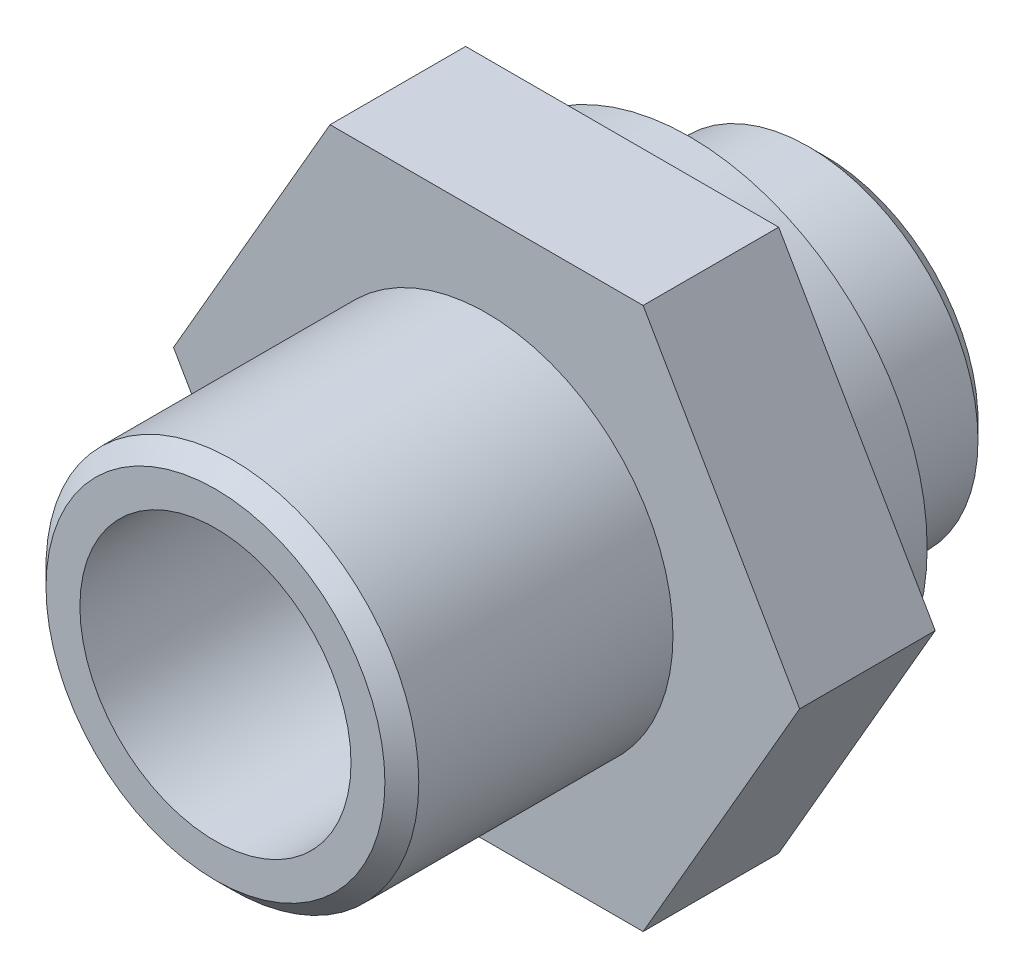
ISO-10303-21;
HEADER;
FILE_DESCRIPTION(('STEP AP214'),'2;1');
FILE_NAME('part.step','',(''),(''),'','','');
FILE_SCHEMA(('AUTOMOTIVE_DESIGN { 1 0 10303 214 1 1 1 1 }'));
ENDSEC;
DATA;
#1=APPLICATION_CONTEXT('core data for automotive mechanical design processes');
#2=APPLICATION_PROTOCOL_DEFINITION('international standard','automotive_design',2000,#1);
#3=PRODUCT_CONTEXT('',#1,'mechanical');
#4=PRODUCT('Part','Part','',(#3));
#5=PRODUCT_RELATED_PRODUCT_CATEGORY('part','',(#4));
#6=PRODUCT_DEFINITION_FORMATION('','',#4);
#7=PRODUCT_DEFINITION_CONTEXT('part definition',#1,'design');
#8=PRODUCT_DEFINITION('design','',#6,#7);
#9=PRODUCT_DEFINITION_SHAPE('','',#8);
#10=(LENGTH_UNIT() NAMED_UNIT(*) SI_UNIT(.MILLI.,.METRE.));
#11=(NAMED_UNIT(*) PLANE_ANGLE_UNIT() SI_UNIT($,.RADIAN.));
#12=(NAMED_UNIT(*) SI_UNIT($,.STERADIAN.) SOLID_ANGLE_UNIT());
#13=UNCERTAINTY_MEASURE_WITH_UNIT(LENGTH_MEASURE(1.E-05),#10,'distance_accuracy_value','');
#14=(GEOMETRIC_REPRESENTATION_CONTEXT(3) GLOBAL_UNCERTAINTY_ASSIGNED_CONTEXT((#13)) GLOBAL_UNIT_ASSIGNED_CONTEXT((#10,
#11,#12)) REPRESENTATION_CONTEXT('',''));
#15=CARTESIAN_POINT('',(0.,0.,0.));
#16=DIRECTION('',(0.,0.,1.));
#17=DIRECTION('',(1.,0.,0.));
#18=AXIS2_PLACEMENT_3D('',#15,#16,#17);
#19=CARTESIAN_POINT('',(-2.30940107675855,3.99999999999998,2.));
#20=DIRECTION('',(0.866025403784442,-0.499999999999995,0.));
#21=DIRECTION('',(0.499999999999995,0.866025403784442,0.));
#22=AXIS2_PLACEMENT_3D('',#19,#20,#21);
#23=PLANE('',#22);
#24=DIRECTION('',(-0.499999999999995,-0.866025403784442,0.));
#25=VECTOR('',#24,1.);
#26=CARTESIAN_POINT('',(-2.30940107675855,3.99999999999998,0.));
#27=LINE('',#26,#25);
#28=CARTESIAN_POINT('',(-2.30940107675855,3.99999999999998,0.));
#29=VERTEX_POINT('',#28);
#30=CARTESIAN_POINT('',(-4.61880215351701,0.,0.));
#31=VERTEX_POINT('',#30);
#32=EDGE_CURVE('E122',#29,#31,#27,.T.);
#33=ORIENTED_EDGE('',*,*,#32,.T.);
#34=DIRECTION('',(0.,0.,-1.));
#35=VECTOR('',#34,1.);
#36=CARTESIAN_POINT('',(-4.61880215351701,0.,2.));
#37=LINE('',#36,#35);
#38=CARTESIAN_POINT('',(-4.61880215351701,0.,2.));
#39=VERTEX_POINT('',#38);
#40=EDGE_CURVE('E140',#39,#31,#37,.T.);
#41=ORIENTED_EDGE('',*,*,#40,.F.);
#42=DIRECTION('',(-0.499999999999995,-0.866025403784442,0.));
#43=VECTOR('',#42,1.);
#44=CARTESIAN_POINT('',(-2.30940107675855,3.99999999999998,2.));
#45=LINE('',#44,#43);
#46=CARTESIAN_POINT('',(-2.30940107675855,3.99999999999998,2.));
#47=VERTEX_POINT('',#46);
#48=EDGE_CURVE('E133',#47,#39,#45,.T.);
#49=ORIENTED_EDGE('',*,*,#48,.F.);
#50=DIRECTION('',(0.,0.,-1.));
#51=VECTOR('',#50,1.);
#52=CARTESIAN_POINT('',(-2.30940107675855,3.99999999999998,2.));
#53=LINE('',#52,#51);
#54=EDGE_CURVE('E118',#47,#29,#53,.T.);
#55=ORIENTED_EDGE('',*,*,#54,.T.);
#56=EDGE_LOOP('',(#33,#41,#49,#55));
#57=FACE_BOUND('',#56,.T.);
#58=ADVANCED_FACE('F35',(#57),#23,.F.);
#59=CARTESIAN_POINT('',(-4.61880215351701,0.,2.));
#60=DIRECTION('',(0.866025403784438,0.500000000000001,0.));
#61=DIRECTION('',(-0.500000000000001,0.866025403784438,0.));
#62=AXIS2_PLACEMENT_3D('',#59,#60,#61);
#63=PLANE('',#62);
#64=DIRECTION('',(0.500000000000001,-0.866025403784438,0.));
#65=VECTOR('',#64,1.);
#66=CARTESIAN_POINT('',(-4.61880215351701,0.,0.));
#67=LINE('',#66,#65);
#68=CARTESIAN_POINT('',(-2.3094010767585,-4.00000000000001,0.));
#69=VERTEX_POINT('',#68);
#70=EDGE_CURVE('E125',#31,#69,#67,.T.);
#71=ORIENTED_EDGE('',*,*,#70,.T.);
#72=DIRECTION('',(0.,0.,-1.));
#73=VECTOR('',#72,1.);
#74=CARTESIAN_POINT('',(-2.3094010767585,-4.00000000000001,2.));
#75=LINE('',#74,#73);
#76=CARTESIAN_POINT('',(-2.3094010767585,-4.00000000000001,2.));
#77=VERTEX_POINT('',#76);
#78=EDGE_CURVE('E137',#77,#69,#75,.T.);
#79=ORIENTED_EDGE('',*,*,#78,.F.);
#80=DIRECTION('',(0.500000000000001,-0.866025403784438,0.));
#81=VECTOR('',#80,1.);
#82=CARTESIAN_POINT('',(-4.61880215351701,0.,2.));
#83=LINE('',#82,#81);
#84=EDGE_CURVE('E91',#39,#77,#83,.T.);
#85=ORIENTED_EDGE('',*,*,#84,.F.);
#86=ORIENTED_EDGE('',*,*,#40,.T.);
#87=EDGE_LOOP('',(#71,#79,#85,#86));
#88=FACE_BOUND('',#87,.T.);
#89=ADVANCED_FACE('F165',(#88),#63,.F.);
#90=CARTESIAN_POINT('',(-2.3094010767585,-4.00000000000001,2.));
#91=DIRECTION('',(0.,1.,0.));
#92=DIRECTION('',(-1.,0.,0.));
#93=AXIS2_PLACEMENT_3D('',#90,#91,#92);
#94=PLANE('',#93);
#95=DIRECTION('',(1.,0.,0.));
#96=VECTOR('',#95,1.);
#97=CARTESIAN_POINT('',(-2.3094010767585,-4.00000000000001,0.));
#98=LINE('',#97,#96);
#99=CARTESIAN_POINT('',(2.30940107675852,-3.99999999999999,0.));
#100=VERTEX_POINT('',#99);
#101=EDGE_CURVE('E128',#69,#100,#98,.T.);
#102=ORIENTED_EDGE('',*,*,#101,.T.);
#103=DIRECTION('',(0.,0.,-1.));
#104=VECTOR('',#103,1.);
#105=CARTESIAN_POINT('',(2.30940107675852,-3.99999999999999,2.));
#106=LINE('',#105,#104);
#107=CARTESIAN_POINT('',(2.30940107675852,-3.99999999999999,2.));
#108=VERTEX_POINT('',#107);
#109=EDGE_CURVE('E113',#108,#100,#106,.T.);
#110=ORIENTED_EDGE('',*,*,#109,.F.);
#111=DIRECTION('',(1.,0.,0.));
#112=VECTOR('',#111,1.);
#113=CARTESIAN_POINT('',(-2.3094010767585,-4.00000000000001,2.));
#114=LINE('',#113,#112);
#115=EDGE_CURVE('E104',#77,#108,#114,.T.);
#116=ORIENTED_EDGE('',*,*,#115,.F.);
#117=ORIENTED_EDGE('',*,*,#78,.T.);
#118=EDGE_LOOP('',(#102,#110,#116,#117));
#119=FACE_BOUND('',#118,.T.);
#120=ADVANCED_FACE('F171',(#119),#94,.F.);
#121=CARTESIAN_POINT('',(2.30940107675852,-3.99999999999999,2.));
#122=DIRECTION('',(-0.866025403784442,0.499999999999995,0.));
#123=DIRECTION('',(-0.499999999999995,-0.866025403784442,0.));
#124=AXIS2_PLACEMENT_3D('',#121,#122,#123);
#125=PLANE('',#124);
#126=DIRECTION('',(0.499999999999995,0.866025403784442,0.));
#127=VECTOR('',#126,1.);
#128=CARTESIAN_POINT('',(2.30940107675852,-3.99999999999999,0.));
#129=LINE('',#128,#127);
#130=CARTESIAN_POINT('',(4.61880215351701,0.,0.));
#131=VERTEX_POINT('',#130);
#132=EDGE_CURVE('E112',#100,#131,#129,.T.);
#133=ORIENTED_EDGE('',*,*,#132,.T.);
#134=DIRECTION('',(0.,0.,-1.));
#135=VECTOR('',#134,1.);
#136=CARTESIAN_POINT('',(4.61880215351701,0.,2.));
#137=LINE('',#136,#135);
#138=CARTESIAN_POINT('',(4.61880215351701,0.,2.));
#139=VERTEX_POINT('',#138);
#140=EDGE_CURVE('E109',#139,#131,#137,.T.);
#141=ORIENTED_EDGE('',*,*,#140,.F.);
#142=DIRECTION('',(0.499999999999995,0.866025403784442,0.));
#143=VECTOR('',#142,1.);
#144=CARTESIAN_POINT('',(2.30940107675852,-3.99999999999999,2.));
#145=LINE('',#144,#143);
#146=EDGE_CURVE('E98',#108,#139,#145,.T.);
#147=ORIENTED_EDGE('',*,*,#146,.F.);
#148=ORIENTED_EDGE('',*,*,#109,.T.);
#149=EDGE_LOOP('',(#133,#141,#147,#148));
#150=FACE_BOUND('',#149,.T.);
#151=ADVANCED_FACE('F110',(#150),#125,.F.);
#152=CARTESIAN_POINT('',(4.61880215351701,0.,2.));
#153=DIRECTION('',(-0.866025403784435,-0.500000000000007,0.));
#154=DIRECTION('',(0.500000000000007,-0.866025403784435,0.));
#155=AXIS2_PLACEMENT_3D('',#152,#153,#154);
#156=PLANE('',#155);
#157=DIRECTION('',(-0.500000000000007,0.866025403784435,0.));
#158=VECTOR('',#157,1.);
#159=CARTESIAN_POINT('',(4.61880215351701,0.,0.));
#160=LINE('',#159,#158);
#161=CARTESIAN_POINT('',(2.30940107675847,4.00000000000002,0.));
#162=VERTEX_POINT('',#161);
#163=EDGE_CURVE('E76',#131,#162,#160,.T.);
#164=ORIENTED_EDGE('',*,*,#163,.T.);
#165=DIRECTION('',(0.,0.,-1.));
#166=VECTOR('',#165,1.);
#167=CARTESIAN_POINT('',(2.30940107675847,4.00000000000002,2.));
#168=LINE('',#167,#166);
#169=CARTESIAN_POINT('',(2.30940107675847,4.00000000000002,2.));
#170=VERTEX_POINT('',#169);
#171=EDGE_CURVE('E114',#170,#162,#168,.T.);
#172=ORIENTED_EDGE('',*,*,#171,.F.);
#173=DIRECTION('',(-0.500000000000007,0.866025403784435,0.));
#174=VECTOR('',#173,1.);
#175=CARTESIAN_POINT('',(4.61880215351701,0.,2.));
#176=LINE('',#175,#174);
#177=EDGE_CURVE('E102',#139,#170,#176,.T.);
#178=ORIENTED_EDGE('',*,*,#177,.F.);
#179=ORIENTED_EDGE('',*,*,#140,.T.);
#180=EDGE_LOOP('',(#164,#172,#178,#179));
#181=FACE_BOUND('',#180,.T.);
#182=ADVANCED_FACE('F116',(#181),#156,.F.);
#183=CARTESIAN_POINT('',(2.30940107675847,4.00000000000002,2.));
#184=DIRECTION('',(0.,-1.,0.));
#185=DIRECTION('',(1.,0.,0.));
#186=AXIS2_PLACEMENT_3D('',#183,#184,#185);
#187=PLANE('',#186);
#188=DIRECTION('',(-1.,0.,0.));
#189=VECTOR('',#188,1.);
#190=CARTESIAN_POINT('',(2.30940107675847,4.00000000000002,0.));
#191=LINE('',#190,#189);
#192=EDGE_CURVE('E82',#162,#29,#191,.T.);
#193=ORIENTED_EDGE('',*,*,#192,.T.);
#194=ORIENTED_EDGE('',*,*,#54,.F.);
#195=DIRECTION('',(-1.,0.,0.));
#196=VECTOR('',#195,1.);
#197=CARTESIAN_POINT('',(2.30940107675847,4.00000000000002,2.));
#198=LINE('',#197,#196);
#199=EDGE_CURVE('E53',#170,#47,#198,.T.);
#200=ORIENTED_EDGE('',*,*,#199,.F.);
#201=ORIENTED_EDGE('',*,*,#171,.T.);
#202=EDGE_LOOP('',(#193,#194,#200,#201));
#203=FACE_BOUND('',#202,.T.);
#204=ADVANCED_FACE('F186',(#203),#187,.F.);
#205=CARTESIAN_POINT('',(0.,0.,2.));
#206=DIRECTION('',(0.,0.,1.));
#207=DIRECTION('',(1.,0.,0.));
#208=AXIS2_PLACEMENT_3D('',#205,#206,#207);
#209=PLANE('',#208);
#210=CARTESIAN_POINT('',(0.,0.,2.));
#211=DIRECTION('',(0.,0.,1.));
#212=DIRECTION('',(1.,0.,0.));
#213=AXIS2_PLACEMENT_3D('',#210,#211,#212);
#214=CIRCLE('',#213,2.75);
#215=CARTESIAN_POINT('',(2.75,0.,2.));
#216=VERTEX_POINT('',#215);
#217=EDGE_CURVE('E142',#216,#216,#214,.T.);
#218=ORIENTED_EDGE('',*,*,#217,.F.);
#219=EDGE_LOOP('',(#218));
#220=FACE_BOUND('',#219,.T.);
#221=ORIENTED_EDGE('',*,*,#48,.T.);
#222=ORIENTED_EDGE('',*,*,#84,.T.);
#223=ORIENTED_EDGE('',*,*,#115,.T.);
#224=ORIENTED_EDGE('',*,*,#146,.T.);
#225=ORIENTED_EDGE('',*,*,#177,.T.);
#226=ORIENTED_EDGE('',*,*,#199,.T.);
#227=EDGE_LOOP('',(#221,#222,#223,#224,#225,#226));
#228=FACE_BOUND('',#227,.T.);
#229=ADVANCED_FACE('F100',(#220,#228),#209,.T.);
#230=CARTESIAN_POINT('',(0.,0.,0.));
#231=DIRECTION('',(0.,0.,1.));
#232=DIRECTION('',(1.,0.,0.));
#233=AXIS2_PLACEMENT_3D('',#230,#231,#232);
#234=PLANE('',#233);
#235=CARTESIAN_POINT('',(0.,0.,0.));
#236=DIRECTION('',(0.,0.,-1.));
#237=DIRECTION('',(-1.,0.,0.));
#238=AXIS2_PLACEMENT_3D('',#235,#236,#237);
#239=CIRCLE('',#238,3.5);
#240=CARTESIAN_POINT('',(-3.5,0.,0.));
#241=VERTEX_POINT('',#240);
#242=EDGE_CURVE('E234',#241,#241,#239,.T.);
#243=ORIENTED_EDGE('',*,*,#242,.F.);
#244=EDGE_LOOP('',(#243));
#245=FACE_BOUND('',#244,.T.);
#246=ORIENTED_EDGE('',*,*,#32,.F.);
#247=ORIENTED_EDGE('',*,*,#192,.F.);
#248=ORIENTED_EDGE('',*,*,#163,.F.);
#249=ORIENTED_EDGE('',*,*,#132,.F.);
#250=ORIENTED_EDGE('',*,*,#101,.F.);
#251=ORIENTED_EDGE('',*,*,#70,.F.);
#252=EDGE_LOOP('',(#246,#247,#248,#249,#250,#251));
#253=FACE_BOUND('',#252,.T.);
#254=ADVANCED_FACE('F189',(#245,#253),#234,.F.);
#255=CARTESIAN_POINT('',(0.,0.,6.));
#256=DIRECTION('',(0.,0.,-1.));
#257=DIRECTION('',(-1.,0.,0.));
#258=AXIS2_PLACEMENT_3D('',#255,#256,#257);
#259=CYLINDRICAL_SURFACE('',#258,2.75);
#260=CARTESIAN_POINT('',(0.,0.,5.75));
#261=DIRECTION('',(0.,0.,1.));
#262=DIRECTION('',(1.,0.,0.));
#263=AXIS2_PLACEMENT_3D('',#260,#261,#262);
#264=CIRCLE('',#263,2.75);
#265=CARTESIAN_POINT('',(2.75,0.,5.75));
#266=VERTEX_POINT('',#265);
#267=EDGE_CURVE('E146',#266,#266,#264,.F.);
#268=ORIENTED_EDGE('',*,*,#267,.T.);
#269=EDGE_LOOP('',(#268));
#270=FACE_BOUND('',#269,.T.);
#271=ORIENTED_EDGE('',*,*,#217,.T.);
#272=EDGE_LOOP('',(#271));
#273=FACE_BOUND('',#272,.T.);
#274=ADVANCED_FACE('F192',(#270,#273),#259,.T.);
#275=CARTESIAN_POINT('',(0.,0.,6.));
#276=DIRECTION('',(0.,0.,1.));
#277=DIRECTION('',(1.,0.,0.));
#278=AXIS2_PLACEMENT_3D('',#275,#276,#277);
#279=PLANE('',#278);
#280=CARTESIAN_POINT('',(0.,0.,6.));
#281=DIRECTION('',(0.,0.,1.));
#282=DIRECTION('',(1.,0.,0.));
#283=AXIS2_PLACEMENT_3D('',#280,#281,#282);
#284=CIRCLE('',#283,2.5);
#285=CARTESIAN_POINT('',(2.5,0.,6.));
#286=VERTEX_POINT('',#285);
#287=EDGE_CURVE('E143',#286,#286,#284,.T.);
#288=ORIENTED_EDGE('',*,*,#287,.T.);
#289=EDGE_LOOP('',(#288));
#290=FACE_BOUND('',#289,.T.);
#291=CARTESIAN_POINT('',(0.,0.,6.));
#292=DIRECTION('',(0.,0.,1.));
#293=DIRECTION('',(1.,0.,0.));
#294=AXIS2_PLACEMENT_3D('',#291,#292,#293);
#295=CIRCLE('',#294,2.);
#296=CARTESIAN_POINT('',(2.,0.,6.));
#297=VERTEX_POINT('',#296);
#298=EDGE_CURVE('E225',#297,#297,#295,.T.);
#299=ORIENTED_EDGE('',*,*,#298,.F.);
#300=EDGE_LOOP('',(#299));
#301=FACE_BOUND('',#300,.T.);
#302=ADVANCED_FACE('F199',(#290,#301),#279,.T.);
#303=CARTESIAN_POINT('',(0.,0.,-1.));
#304=DIRECTION('',(0.,0.,1.));
#305=DIRECTION('',(1.,0.,0.));
#306=AXIS2_PLACEMENT_3D('',#303,#304,#305);
#307=CYLINDRICAL_SURFACE('',#306,3.5);
#308=CARTESIAN_POINT('',(0.,0.,-1.));
#309=DIRECTION('',(0.,0.,-1.));
#310=DIRECTION('',(-1.,0.,0.));
#311=AXIS2_PLACEMENT_3D('',#308,#309,#310);
#312=CIRCLE('',#311,3.5);
#313=CARTESIAN_POINT('',(-3.5,0.,-1.));
#314=VERTEX_POINT('',#313);
#315=EDGE_CURVE('E126',#314,#314,#312,.T.);
#316=ORIENTED_EDGE('',*,*,#315,.F.);
#317=EDGE_LOOP('',(#316));
#318=FACE_BOUND('',#317,.T.);
#319=ORIENTED_EDGE('',*,*,#242,.T.);
#320=EDGE_LOOP('',(#319));
#321=FACE_BOUND('',#320,.T.);
#322=ADVANCED_FACE('F203',(#318,#321),#307,.T.);
#323=CARTESIAN_POINT('',(0.,0.,-1.));
#324=DIRECTION('',(0.,0.,-1.));
#325=DIRECTION('',(-1.,0.,0.));
#326=AXIS2_PLACEMENT_3D('',#323,#324,#325);
#327=PLANE('',#326);
#328=CARTESIAN_POINT('',(0.,0.,-1.));
#329=DIRECTION('',(0.,0.,-1.));
#330=DIRECTION('',(-1.,0.,0.));
#331=AXIS2_PLACEMENT_3D('',#328,#329,#330);
#332=CIRCLE('',#331,2.5);
#333=CARTESIAN_POINT('',(-2.5,0.,-1.));
#334=VERTEX_POINT('',#333);
#335=EDGE_CURVE('E147',#334,#334,#332,.T.);
#336=ORIENTED_EDGE('',*,*,#335,.F.);
#337=EDGE_LOOP('',(#336));
#338=FACE_BOUND('',#337,.T.);
#339=ORIENTED_EDGE('',*,*,#315,.T.);
#340=EDGE_LOOP('',(#339));
#341=FACE_BOUND('',#340,.T.);
#342=ADVANCED_FACE('F207',(#338,#341),#327,.T.);
#343=CARTESIAN_POINT('',(0.,0.,-3.));
#344=DIRECTION('',(0.,0.,1.));
#345=DIRECTION('',(1.,0.,0.));
#346=AXIS2_PLACEMENT_3D('',#343,#344,#345);
#347=CYLINDRICAL_SURFACE('',#346,2.5);
#348=CARTESIAN_POINT('',(0.,0.,-2.75));
#349=DIRECTION('',(0.,0.,-1.));
#350=DIRECTION('',(-1.,0.,0.));
#351=AXIS2_PLACEMENT_3D('',#348,#349,#350);
#352=CIRCLE('',#351,2.5);
#353=CARTESIAN_POINT('',(-2.5,0.,-2.75));
#354=VERTEX_POINT('',#353);
#355=EDGE_CURVE('E11',#354,#354,#352,.F.);
#356=ORIENTED_EDGE('',*,*,#355,.T.);
#357=EDGE_LOOP('',(#356));
#358=FACE_BOUND('',#357,.T.);
#359=ORIENTED_EDGE('',*,*,#335,.T.);
#360=EDGE_LOOP('',(#359));
#361=FACE_BOUND('',#360,.T.);
#362=ADVANCED_FACE('F211',(#358,#361),#347,.T.);
#363=CARTESIAN_POINT('',(0.,0.,-3.));
#364=DIRECTION('',(0.,0.,-1.));
#365=DIRECTION('',(-1.,0.,0.));
#366=AXIS2_PLACEMENT_3D('',#363,#364,#365);
#367=PLANE('',#366);
#368=CARTESIAN_POINT('',(0.,0.,-3.));
#369=DIRECTION('',(0.,0.,-1.));
#370=DIRECTION('',(-1.,0.,0.));
#371=AXIS2_PLACEMENT_3D('',#368,#369,#370);
#372=CIRCLE('',#371,2.25);
#373=CARTESIAN_POINT('',(-2.25,0.,-3.));
#374=VERTEX_POINT('',#373);
#375=EDGE_CURVE('E45',#374,#374,#372,.T.);
#376=ORIENTED_EDGE('',*,*,#375,.T.);
#377=EDGE_LOOP('',(#376));
#378=FACE_BOUND('',#377,.T.);
#379=CARTESIAN_POINT('',(0.,0.,-3.));
#380=DIRECTION('',(0.,0.,-1.));
#381=DIRECTION('',(-1.,0.,0.));
#382=AXIS2_PLACEMENT_3D('',#379,#380,#381);
#383=CIRCLE('',#382,2.);
#384=CARTESIAN_POINT('',(-2.,0.,-3.));
#385=VERTEX_POINT('',#384);
#386=EDGE_CURVE('E228',#385,#385,#383,.T.);
#387=ORIENTED_EDGE('',*,*,#386,.F.);
#388=EDGE_LOOP('',(#387));
#389=FACE_BOUND('',#388,.T.);
#390=ADVANCED_FACE('F152',(#378,#389),#367,.T.);
#391=CARTESIAN_POINT('',(0.,0.,7.));
#392=DIRECTION('',(0.,0.,-1.));
#393=DIRECTION('',(-1.,0.,0.));
#394=AXIS2_PLACEMENT_3D('',#391,#392,#393);
#395=CYLINDRICAL_SURFACE('',#394,2.);
#396=ORIENTED_EDGE('',*,*,#298,.T.);
#397=EDGE_LOOP('',(#396));
#398=FACE_BOUND('',#397,.T.);
#399=ORIENTED_EDGE('',*,*,#386,.T.);
#400=EDGE_LOOP('',(#399));
#401=FACE_BOUND('',#400,.T.);
#402=ADVANCED_FACE('F161',(#398,#401),#395,.F.);
#403=CARTESIAN_POINT('',(0.,0.,6.));
#404=DIRECTION('',(0.,0.,-1.));
#405=DIRECTION('',(-1.,0.,0.));
#406=AXIS2_PLACEMENT_3D('',#403,#404,#405);
#407=CONICAL_SURFACE('',#406,2.5,0.785398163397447);
#408=ORIENTED_EDGE('',*,*,#267,.F.);
#409=EDGE_LOOP('',(#408));
#410=FACE_BOUND('',#409,.T.);
#411=ORIENTED_EDGE('',*,*,#287,.F.);
#412=EDGE_LOOP('',(#411));
#413=FACE_BOUND('',#412,.T.);
#414=ADVANCED_FACE('F156',(#410,#413),#407,.T.);
#415=CARTESIAN_POINT('',(0.,0.,-3.));
#416=DIRECTION('',(0.,0.,1.));
#417=DIRECTION('',(1.,0.,0.));
#418=AXIS2_PLACEMENT_3D('',#415,#416,#417);
#419=CONICAL_SURFACE('',#418,2.25,0.785398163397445);
#420=ORIENTED_EDGE('',*,*,#355,.F.);
#421=EDGE_LOOP('',(#420));
#422=FACE_BOUND('',#421,.T.);
#423=ORIENTED_EDGE('',*,*,#375,.F.);
#424=EDGE_LOOP('',(#423));
#425=FACE_BOUND('',#424,.T.);
#426=ADVANCED_FACE('F38',(#422,#425),#419,.T.);
#427=CLOSED_SHELL('',(#58,#89,#120,#151,#182,#204,#229,#254,#274,#302,#322,#342,#362,#390,#402,
#414,#426));
#428=MANIFOLD_SOLID_BREP('B2',#427);
#429=ADVANCED_BREP_SHAPE_REPRESENTATION('',(#18,#428),#14);
#430=SHAPE_DEFINITION_REPRESENTATION(#9,#429);
ENDSEC;
END-ISO-10303-21;
